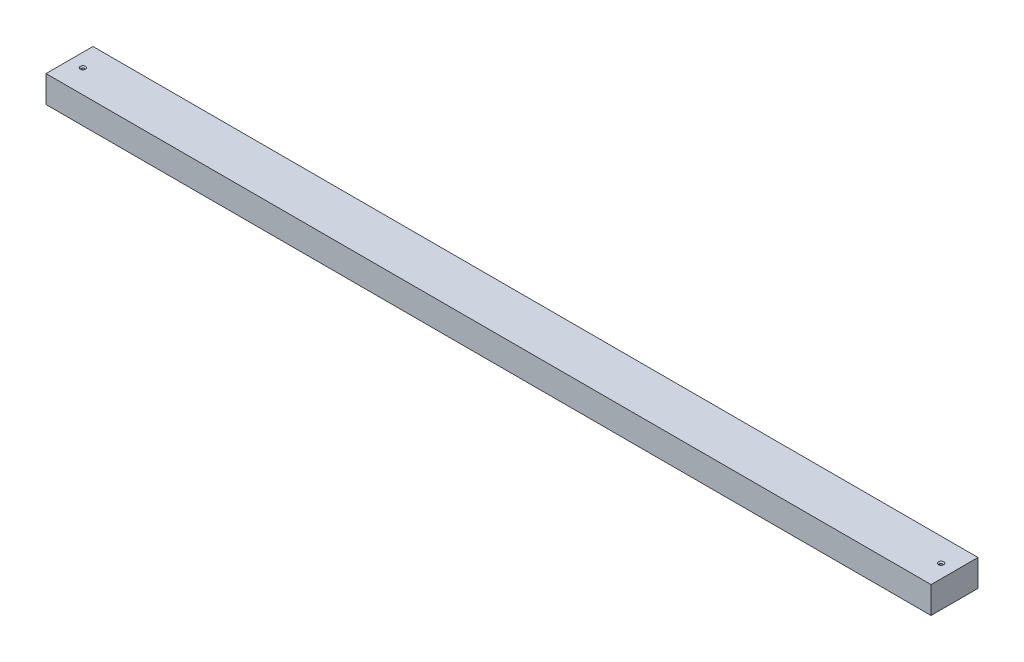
from build123d import *

# Parameters (mm, degrees)
SKETCH1_W                                          = 1676.4
SKETCH1_H                                          = 88.9
BOSS_EXTRUDE1_DEPTH                                = 50.8
CSK_FOR_10_FLAT_HEAD_MACHINE_SCREW_100_D           = 5.1054
CSK_FOR_10_FLAT_HEAD_MACHINE_SCREW_100_DEPTH       = 50.8
CSK_FOR_10_FLAT_HEAD_MACHINE_SCREW_100_CSINK_D     = 9.779
CSK_FOR_10_FLAT_HEAD_MACHINE_SCREW_100_CSINK_ANGLE = 100
CSK_FOR_10_FLAT_HEAD_MACHINE_SCREW_100_TIP         = 1.533816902


with BuildPart() as part:
    # Sketch1 → Boss-Extrude1 (new body)
    with BuildSketch(Plane(origin=(0, 0, 0), x_dir=(1, 0, 0), z_dir=(0, 1, 0))):
        Rectangle(SKETCH1_W, SKETCH1_H)
    extrude(amount=BOSS_EXTRUDE1_DEPTH)

    # CSK for _10 Flat Head Machine Screw _100
    with Locations(Plane(origin=(0, 50.8, 0), x_dir=(1, 0, 0), z_dir=(0, 1, 0))):
        with Locations((-812.8, 0), (812.8, 0)):
            CounterSinkHole(CSK_FOR_10_FLAT_HEAD_MACHINE_SCREW_100_D / 2, CSK_FOR_10_FLAT_HEAD_MACHINE_SCREW_100_CSINK_D / 2, depth=CSK_FOR_10_FLAT_HEAD_MACHINE_SCREW_100_DEPTH, counter_sink_angle=CSK_FOR_10_FLAT_HEAD_MACHINE_SCREW_100_CSINK_ANGLE)
            with Locations((0, 0, -(CSK_FOR_10_FLAT_HEAD_MACHINE_SCREW_100_DEPTH + CSK_FOR_10_FLAT_HEAD_MACHINE_SCREW_100_TIP / 2))):  # 118° drill point
                Cone(0, CSK_FOR_10_FLAT_HEAD_MACHINE_SCREW_100_D / 2, CSK_FOR_10_FLAT_HEAD_MACHINE_SCREW_100_TIP, mode=Mode.SUBTRACT)


solid = part.part
